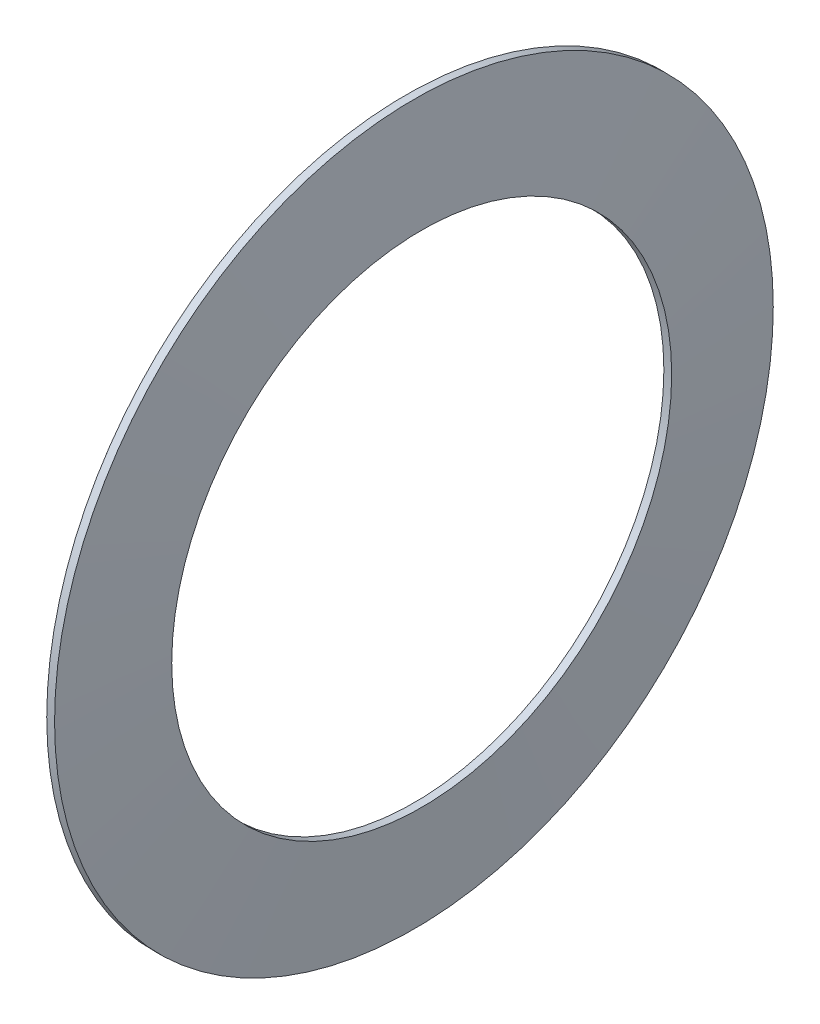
from build123d import *


with BuildPart() as part:
    # Esquisse1 → Base-R_volution (revolve)
    with BuildSketch(Plane.XY, mode=Mode.PRIVATE) as base_r_volution_sk:
        Polygon((0, 23), (0.501267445, 23), (1, 16), (0.498732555, 16), align=None)
    revolve(base_r_volution_sk.sketch.rotate(Axis((0, 0, 0), (1, 0, 0)), 90), axis=Axis((0, 0, 0), (1, 0, 0)))


solid = part.part
